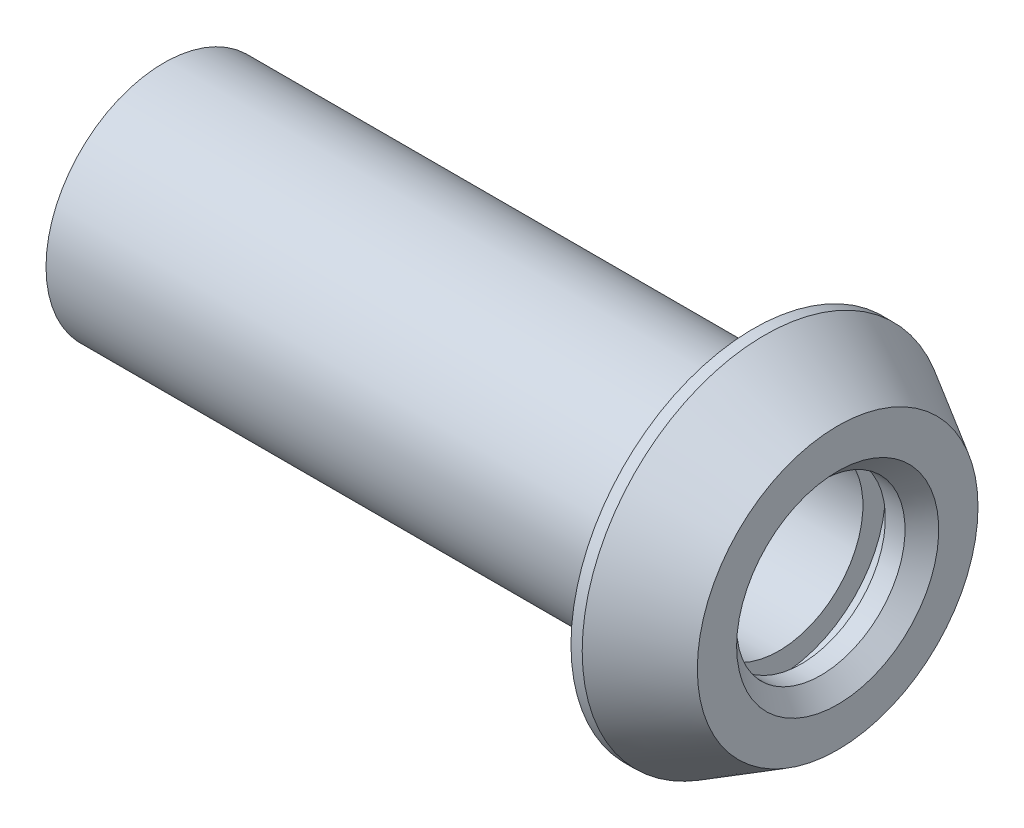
from build123d import *


with BuildPart() as part:
    # Esquisse1 → R_volution1 (revolve)
    with BuildSketch(Plane.XY, mode=Mode.PRIVATE) as r_volution1_sk:
        Polygon((0, 21), (0, 32.5), (2, 32.5), (15, 24.994446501), (15, 18), (12, 15), (8.5, 15), (8.5, 19), (4.5, 19), (4.5, 15), (-18, 15), (-18, 15.75), (-105, 15.75), (-105, 21), align=None)
    revolve(r_volution1_sk.sketch.rotate(Axis((-106.985443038, 0, 0), (1, 0, 0)), 90), axis=Axis((-106.985443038, 0, 0), (1, 0, 0)))


solid = part.part
